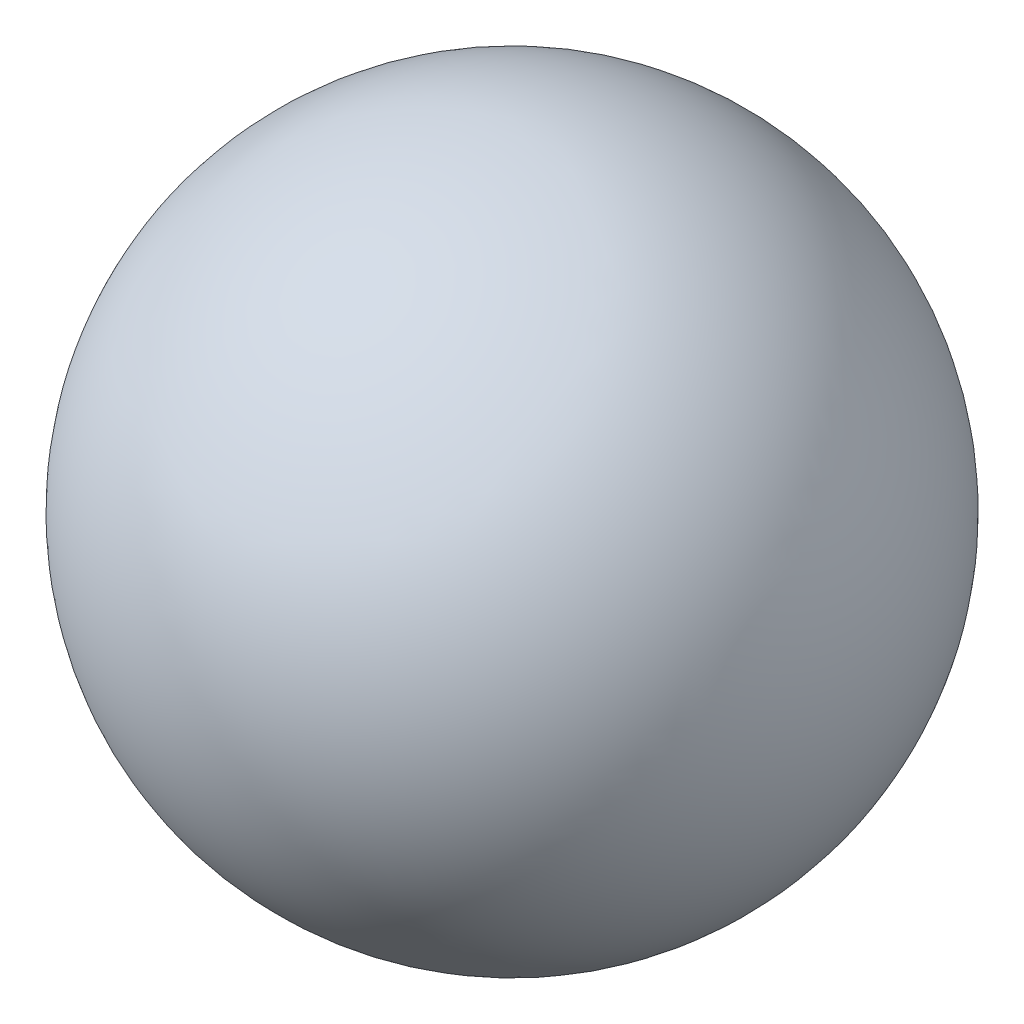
from build123d import *


with BuildPart() as part:
    # Sketch 1 → Revolve 1 (revolve)
    with BuildSketch(Plane.XY):
        with BuildLine():
            Line((-0.083656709, 13.302415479), (4.916343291, 13.302415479))
            ThreePointArc((4.916343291, 13.302415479), (2.416343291, 15.802415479), (-0.083656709, 13.302415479))
        make_face()
    revolve(axis=Axis((8.771574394, 13.302415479, 0), (-1, 0, 0)))


solid = part.part
